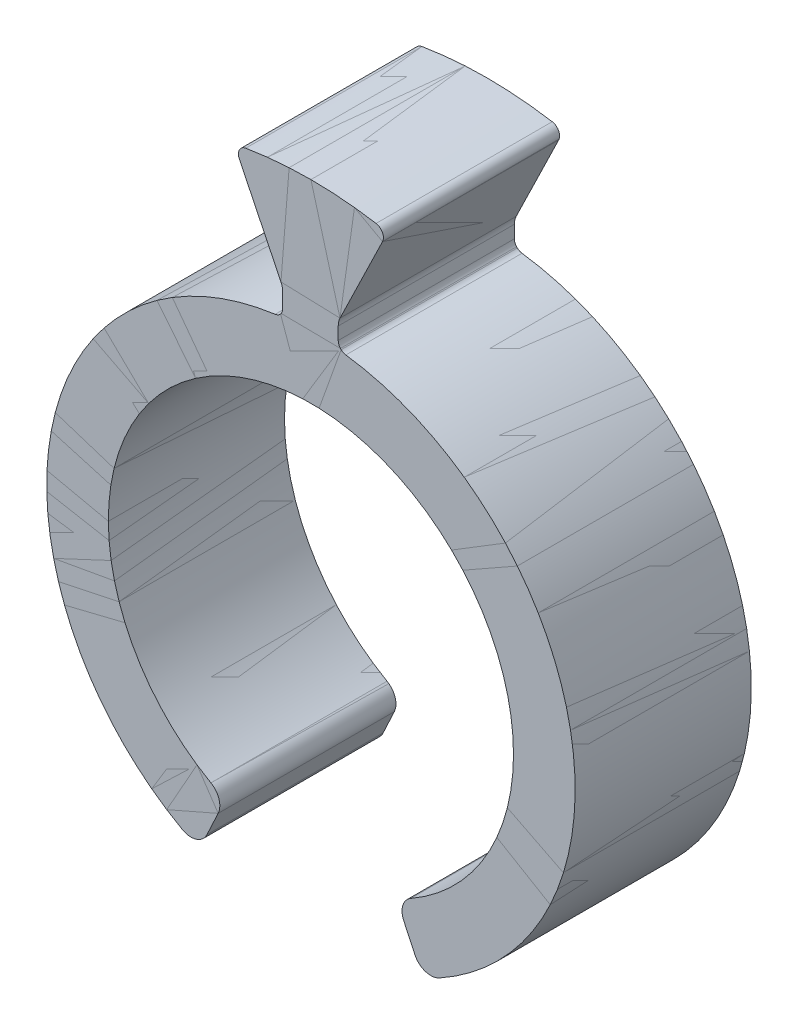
ISO-10303-21;
HEADER;
FILE_DESCRIPTION(('STEP AP214'),'2;1');
FILE_NAME('part.step','',(''),(''),'','','');
FILE_SCHEMA(('AUTOMOTIVE_DESIGN { 1 0 10303 214 1 1 1 1 }'));
ENDSEC;
DATA;
#1=APPLICATION_CONTEXT('core data for automotive mechanical design processes');
#2=APPLICATION_PROTOCOL_DEFINITION('international standard','automotive_design',2000,#1);
#3=PRODUCT_CONTEXT('',#1,'mechanical');
#4=PRODUCT('Part','Part','',(#3));
#5=PRODUCT_RELATED_PRODUCT_CATEGORY('part','',(#4));
#6=PRODUCT_DEFINITION_FORMATION('','',#4);
#7=PRODUCT_DEFINITION_CONTEXT('part definition',#1,'design');
#8=PRODUCT_DEFINITION('design','',#6,#7);
#9=PRODUCT_DEFINITION_SHAPE('','',#8);
#10=(LENGTH_UNIT() NAMED_UNIT(*) SI_UNIT(.MILLI.,.METRE.));
#11=(NAMED_UNIT(*) PLANE_ANGLE_UNIT() SI_UNIT($,.RADIAN.));
#12=(NAMED_UNIT(*) SI_UNIT($,.STERADIAN.) SOLID_ANGLE_UNIT());
#13=UNCERTAINTY_MEASURE_WITH_UNIT(LENGTH_MEASURE(1.E-05),#10,'distance_accuracy_value','');
#14=(GEOMETRIC_REPRESENTATION_CONTEXT(3) GLOBAL_UNCERTAINTY_ASSIGNED_CONTEXT((#13)) GLOBAL_UNIT_ASSIGNED_CONTEXT((#10,
#11,#12)) REPRESENTATION_CONTEXT('',''));
#15=CARTESIAN_POINT('',(0.,0.,0.));
#16=DIRECTION('',(0.,0.,1.));
#17=DIRECTION('',(1.,0.,0.));
#18=AXIS2_PLACEMENT_3D('',#15,#16,#17);
#19=CARTESIAN_POINT('',(8.83337144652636,-6.81471511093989,-5.));
#20=DIRECTION('',(0.,0.,-1.));
#21=DIRECTION('',(-1.,0.,0.));
#22=AXIS2_PLACEMENT_3D('',#19,#20,#21);
#23=PLANE('',#22);
#24=DIRECTION('',(0.43721847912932,0.899355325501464,0.));
#25=VECTOR('',#24,1.);
#26=CARTESIAN_POINT('',(1.9182073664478,10.5053222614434,-5.));
#27=LINE('',#26,#25);
#28=CARTESIAN_POINT('',(0.825161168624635,8.25693394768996,-5.));
#29=VERTEX_POINT('',#28);
#30=CARTESIAN_POINT('',(2.03282757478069,10.7410952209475,-5.));
#31=VERTEX_POINT('',#30);
#32=EDGE_CURVE('P0_E491',#29,#31,#27,.T.);
#33=ORIENTED_EDGE('',*,*,#32,.F.);
#34=CARTESIAN_POINT('',(1.2748388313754,8.0383247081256,-5.));
#35=DIRECTION('',(0.,0.,-1.));
#36=DIRECTION('',(-1.,0.,0.));
#37=AXIS2_PLACEMENT_3D('',#34,#35,#36);
#38=CIRCLE('',#37,0.500000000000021);
#39=CARTESIAN_POINT('',(0.774838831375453,8.03832470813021,-5.));
#40=VERTEX_POINT('',#39);
#41=EDGE_CURVE('P0_E354',#40,#29,#38,.T.);
#42=ORIENTED_EDGE('',*,*,#41,.F.);
#43=DIRECTION('',(1.83880037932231E-11,1.,0.));
#44=VECTOR('',#43,1.);
#45=CARTESIAN_POINT('',(0.77483883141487,10.1819402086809,-5.));
#46=LINE('',#45,#44);
#47=CARTESIAN_POINT('',(0.7748388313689,7.6819402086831,-5.));
#48=VERTEX_POINT('',#47);
#49=EDGE_CURVE('P0_E489',#48,#40,#46,.T.);
#50=ORIENTED_EDGE('',*,*,#49,.F.);
#51=CARTESIAN_POINT('',(1.0248388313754,7.6819402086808,-5.));
#52=DIRECTION('',(0.,0.,-1.));
#53=DIRECTION('',(-1.,0.,0.));
#54=AXIS2_PLACEMENT_3D('',#51,#52,#53);
#55=CIRCLE('',#54,0.250000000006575);
#56=CARTESIAN_POINT('',(0.991779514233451,7.43413568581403,-5.));
#57=VERTEX_POINT('',#56);
#58=EDGE_CURVE('P0_E504',#57,#48,#55,.T.);
#59=ORIENTED_EDGE('',*,*,#58,.F.);
#60=CARTESIAN_POINT('',(0.,0.,-5.));
#61=DIRECTION('',(0.,0.,1.));
#62=DIRECTION('',(0.,-1.,0.));
#63=AXIS2_PLACEMENT_3D('',#60,#61,#62);
#64=CIRCLE('',#63,7.49999999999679);
#65=CARTESIAN_POINT('',(3.64706284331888,-6.55354351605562,-5.));
#66=VERTEX_POINT('',#65);
#67=EDGE_CURVE('P0_E582',#57,#66,#64,.F.);
#68=ORIENTED_EDGE('',*,*,#67,.T.);
#69=CARTESIAN_POINT('',(3.4039253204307,-6.1166406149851,-5.));
#70=DIRECTION('',(0.,0.,1.));
#71=DIRECTION('',(1.,0.,0.));
#72=AXIS2_PLACEMENT_3D('',#69,#70,#71);
#73=CIRCLE('',#72,0.500000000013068);
#74=CARTESIAN_POINT('',(2.950771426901,-6.32794974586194,-5.));
#75=VERTEX_POINT('',#74);
#76=EDGE_CURVE('P0_E512',#66,#75,#73,.F.);
#77=ORIENTED_EDGE('',*,*,#76,.T.);
#78=DIRECTION('',(0.42261826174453,-0.906307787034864,0.));
#79=VECTOR('',#78,1.);
#80=CARTESIAN_POINT('',(3.68944385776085,-7.912037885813,-5.));
#81=LINE('',#80,#79);
#82=CARTESIAN_POINT('',(2.63289820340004,-5.64626841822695,-5.));
#83=VERTEX_POINT('',#82);
#84=EDGE_CURVE('P0_E509',#83,#75,#81,.T.);
#85=ORIENTED_EDGE('',*,*,#84,.F.);
#86=CARTESIAN_POINT('',(3.0860520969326,-5.4349592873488,-5.));
#87=DIRECTION('',(0.,0.,1.));
#88=DIRECTION('',(0.,-1.,0.));
#89=AXIS2_PLACEMENT_3D('',#86,#87,#88);
#90=CIRCLE('',#89,0.50000000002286);
#91=CARTESIAN_POINT('',(2.83916792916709,-5.00016254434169,-5.));
#92=VERTEX_POINT('',#91);
#93=EDGE_CURVE('P0_E587',#83,#92,#90,.F.);
#94=ORIENTED_EDGE('',*,*,#93,.T.);
#95=CARTESIAN_POINT('',(0.,0.,-5.));
#96=DIRECTION('',(0.,0.,-1.));
#97=DIRECTION('',(-1.,0.,0.));
#98=AXIS2_PLACEMENT_3D('',#95,#96,#97);
#99=CIRCLE('',#98,5.7499999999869);
#100=CARTESIAN_POINT('',(-2.83916792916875,-5.00016254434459,-5.));
#101=VERTEX_POINT('',#100);
#102=EDGE_CURVE('P0_E590',#101,#92,#99,.T.);
#103=ORIENTED_EDGE('',*,*,#102,.F.);
#104=CARTESIAN_POINT('',(-3.0860520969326,-5.4349592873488,-5.));
#105=DIRECTION('',(0.,0.,1.));
#106=DIRECTION('',(0.,-1.,0.));
#107=AXIS2_PLACEMENT_3D('',#104,#105,#106);
#108=CIRCLE('',#107,0.50000000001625);
#109=CARTESIAN_POINT('',(-2.6328982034,-5.64626841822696,-5.));
#110=VERTEX_POINT('',#109);
#111=EDGE_CURVE('P0_E517',#101,#110,#108,.F.);
#112=ORIENTED_EDGE('',*,*,#111,.T.);
#113=DIRECTION('',(0.422618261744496,0.90630778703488,0.));
#114=VECTOR('',#113,1.);
#115=CARTESIAN_POINT('',(-1.89422577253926,-4.0621802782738,-5.));
#116=LINE('',#115,#114);
#117=CARTESIAN_POINT('',(-2.95077142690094,-6.32794974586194,-5.));
#118=VERTEX_POINT('',#117);
#119=EDGE_CURVE('P0_E514',#118,#110,#116,.T.);
#120=ORIENTED_EDGE('',*,*,#119,.F.);
#121=CARTESIAN_POINT('',(-3.4039253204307,-6.1166406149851,-5.));
#122=DIRECTION('',(0.,0.,1.));
#123=DIRECTION('',(1.,0.,0.));
#124=AXIS2_PLACEMENT_3D('',#121,#122,#123);
#125=CIRCLE('',#124,0.500000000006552);
#126=CARTESIAN_POINT('',(-3.6470628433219,-6.55354351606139,-5.));
#127=VERTEX_POINT('',#126);
#128=EDGE_CURVE('P0_E596',#118,#127,#125,.F.);
#129=ORIENTED_EDGE('',*,*,#128,.T.);
#130=CARTESIAN_POINT('',(0.,0.,-5.));
#131=DIRECTION('',(0.,0.,1.));
#132=DIRECTION('',(0.,-1.,0.));
#133=AXIS2_PLACEMENT_3D('',#130,#131,#132);
#134=CIRCLE('',#133,7.49999999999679);
#135=CARTESIAN_POINT('',(-1.01612903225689,7.43084664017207,-5.));
#136=VERTEX_POINT('',#135);
#137=EDGE_CURVE('P0_E600',#127,#136,#134,.F.);
#138=ORIENTED_EDGE('',*,*,#137,.T.);
#139=CARTESIAN_POINT('',(-1.0499999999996,7.6785415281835,-5.));
#140=DIRECTION('',(0.,0.,-1.));
#141=DIRECTION('',(-1.,0.,0.));
#142=AXIS2_PLACEMENT_3D('',#139,#140,#141);
#143=CIRCLE('',#142,0.250000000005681);
#144=CARTESIAN_POINT('',(-0.799999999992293,7.67854152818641,-5.));
#145=VERTEX_POINT('',#144);
#146=EDGE_CURVE('P0_E602',#145,#136,#143,.T.);
#147=ORIENTED_EDGE('',*,*,#146,.F.);
#148=DIRECTION('',(2.24620235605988E-11,-1.,0.));
#149=VECTOR('',#148,1.);
#150=CARTESIAN_POINT('',(-0.799999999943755,5.5900810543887,-5.));
#151=LINE('',#150,#149);
#152=CARTESIAN_POINT('',(-0.79999999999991,8.09008105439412,-5.));
#153=VERTEX_POINT('',#152);
#154=EDGE_CURVE('P0_E519',#153,#145,#151,.T.);
#155=ORIENTED_EDGE('',*,*,#154,.F.);
#156=CARTESIAN_POINT('',(-1.2999999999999,8.0900810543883,-5.));
#157=DIRECTION('',(0.,0.,-1.));
#158=DIRECTION('',(-1.,0.,0.));
#159=AXIS2_PLACEMENT_3D('',#156,#157,#158);
#160=CIRCLE('',#159,0.499999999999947);
#161=CARTESIAN_POINT('',(-0.850322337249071,8.30869029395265,-5.));
#162=VERTEX_POINT('',#161);
#163=EDGE_CURVE('P0_E605',#162,#153,#160,.T.);
#164=ORIENTED_EDGE('',*,*,#163,.F.);
#165=DIRECTION('',(0.437218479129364,-0.899355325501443,0.));
#166=VECTOR('',#165,1.);
#167=CARTESIAN_POINT('',(-0.939781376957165,8.49270690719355,-5.));
#168=LINE('',#167,#166);
#169=CARTESIAN_POINT('',(-2.03282757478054,10.7410952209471,-5.));
#170=VERTEX_POINT('',#169);
#171=EDGE_CURVE('P0_E523',#170,#162,#168,.T.);
#172=ORIENTED_EDGE('',*,*,#171,.F.);
#173=CARTESIAN_POINT('',(-1.8079887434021,10.850399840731,-5.));
#174=DIRECTION('',(0.,0.,1.));
#175=DIRECTION('',(0.,-1.,0.));
#176=AXIS2_PLACEMENT_3D('',#173,#174,#175);
#177=CIRCLE('',#176,0.250000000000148);
#178=CARTESIAN_POINT('',(-1.84907939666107,11.0969998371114,-5.));
#179=VERTEX_POINT('',#178);
#180=EDGE_CURVE('P0_E607',#170,#179,#177,.F.);
#181=ORIENTED_EDGE('',*,*,#180,.T.);
#182=CARTESIAN_POINT('',(0.,0.,-5.));
#183=DIRECTION('',(0.,0.,1.));
#184=DIRECTION('',(1.,0.,0.));
#185=AXIS2_PLACEMENT_3D('',#182,#183,#184);
#186=CIRCLE('',#185,11.25);
#187=CARTESIAN_POINT('',(1.84907875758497,11.0969999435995,-5.));
#188=VERTEX_POINT('',#187);
#189=EDGE_CURVE('P0_E611',#179,#188,#186,.F.);
#190=ORIENTED_EDGE('',*,*,#189,.T.);
#191=CARTESIAN_POINT('',(1.8079887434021,10.850399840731,-5.));
#192=DIRECTION('',(0.,0.,1.));
#193=DIRECTION('',(0.,-1.,0.));
#194=AXIS2_PLACEMENT_3D('',#191,#192,#193);
#195=CIRCLE('',#194,0.250000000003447);
#196=EDGE_CURVE('P0_E528',#188,#31,#195,.F.);
#197=ORIENTED_EDGE('',*,*,#196,.T.);
#198=EDGE_LOOP('',(#33,#42,#50,#59,#68,#77,#85,#94,#103,#112,#120,#129,#138,#147,#155,#164,#172,
#181,#190,#197));
#199=FACE_BOUND('',#198,.T.);
#200=ADVANCED_FACE('P0_F350',(#199),#23,.T.);
#201=CARTESIAN_POINT('',(1.2748388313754,8.0383247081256,0.));
#202=DIRECTION('',(0.,0.,-1.));
#203=DIRECTION('',(-1.,0.,0.));
#204=AXIS2_PLACEMENT_3D('',#201,#202,#203);
#205=CYLINDRICAL_SURFACE('',#204,0.500000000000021);
#206=ORIENTED_EDGE('',*,*,#41,.T.);
#207=DIRECTION('',(0.,0.,-1.));
#208=VECTOR('',#207,1.);
#209=CARTESIAN_POINT('',(0.82516116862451,8.2569339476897,-2.5));
#210=LINE('',#209,#208);
#211=CARTESIAN_POINT('',(0.825161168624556,8.25693394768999,0.));
#212=VERTEX_POINT('',#211);
#213=EDGE_CURVE('P0_E494',#212,#29,#210,.T.);
#214=ORIENTED_EDGE('',*,*,#213,.F.);
#215=CARTESIAN_POINT('',(1.2748388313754,8.0383247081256,0.));
#216=DIRECTION('',(0.,0.,-1.));
#217=DIRECTION('',(-1.,0.,0.));
#218=AXIS2_PLACEMENT_3D('',#215,#216,#217);
#219=CIRCLE('',#218,0.500000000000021);
#220=CARTESIAN_POINT('',(0.774838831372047,8.03832470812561,0.));
#221=VERTEX_POINT('',#220);
#222=EDGE_CURVE('P0_E499',#221,#212,#219,.T.);
#223=ORIENTED_EDGE('',*,*,#222,.F.);
#224=DIRECTION('',(0.,0.,1.));
#225=VECTOR('',#224,1.);
#226=CARTESIAN_POINT('',(0.774838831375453,8.03832470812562,-2.5));
#227=LINE('',#226,#225);
#228=EDGE_CURVE('P0_E496',#40,#221,#227,.T.);
#229=ORIENTED_EDGE('',*,*,#228,.F.);
#230=EDGE_LOOP('',(#206,#214,#223,#229));
#231=FACE_BOUND('',#230,.T.);
#232=ADVANCED_FACE('P0_F497',(#231),#205,.F.);
#233=CARTESIAN_POINT('',(0.82516116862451,8.2569339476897,0.));
#234=DIRECTION('',(0.899355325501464,-0.43721847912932,0.));
#235=DIRECTION('',(0.,0.,-1.));
#236=AXIS2_PLACEMENT_3D('',#233,#234,#235);
#237=PLANE('',#236);
#238=ORIENTED_EDGE('',*,*,#32,.T.);
#239=DIRECTION('',(0.,0.,1.));
#240=VECTOR('',#239,1.);
#241=CARTESIAN_POINT('',(2.03282757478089,10.7410952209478,-2.5));
#242=LINE('',#241,#240);
#243=CARTESIAN_POINT('',(2.03282757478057,10.7410952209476,0.));
#244=VERTEX_POINT('',#243);
#245=EDGE_CURVE('P0_E612',#31,#244,#242,.T.);
#246=ORIENTED_EDGE('',*,*,#245,.T.);
#247=DIRECTION('',(0.437218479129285,0.899355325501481,0.));
#248=VECTOR('',#247,1.);
#249=CARTESIAN_POINT('',(0.825161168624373,8.2569339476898,0.));
#250=LINE('',#249,#248);
#251=EDGE_CURVE('P0_E576',#212,#244,#250,.T.);
#252=ORIENTED_EDGE('',*,*,#251,.F.);
#253=ORIENTED_EDGE('',*,*,#213,.T.);
#254=EDGE_LOOP('',(#238,#246,#252,#253));
#255=FACE_BOUND('',#254,.T.);
#256=ADVANCED_FACE('P0_F694',(#255),#237,.T.);
#257=CARTESIAN_POINT('',(1.8079887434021,10.850399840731,-5.));
#258=DIRECTION('',(0.,0.,1.));
#259=DIRECTION('',(0.,-1.,0.));
#260=AXIS2_PLACEMENT_3D('',#257,#258,#259);
#261=CYLINDRICAL_SURFACE('',#260,0.250000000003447);
#262=ORIENTED_EDGE('',*,*,#245,.F.);
#263=ORIENTED_EDGE('',*,*,#196,.F.);
#264=DIRECTION('',(0.,0.,1.));
#265=VECTOR('',#264,1.);
#266=CARTESIAN_POINT('',(1.84907811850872,11.097000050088,-2.5));
#267=LINE('',#266,#265);
#268=CARTESIAN_POINT('',(1.84907875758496,11.0969999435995,0.));
#269=VERTEX_POINT('',#268);
#270=EDGE_CURVE('P0_E610',#188,#269,#267,.T.);
#271=ORIENTED_EDGE('',*,*,#270,.T.);
#272=CARTESIAN_POINT('',(1.8079887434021,10.850399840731,0.));
#273=DIRECTION('',(0.,0.,1.));
#274=DIRECTION('',(0.,-1.,0.));
#275=AXIS2_PLACEMENT_3D('',#272,#273,#274);
#276=CIRCLE('',#275,0.250000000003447);
#277=EDGE_CURVE('P0_E573',#244,#269,#276,.T.);
#278=ORIENTED_EDGE('',*,*,#277,.F.);
#279=EDGE_LOOP('',(#262,#263,#271,#278));
#280=FACE_BOUND('',#279,.T.);
#281=ADVANCED_FACE('P0_F696',(#280),#261,.T.);
#282=CARTESIAN_POINT('',(0.,0.,-5.));
#283=DIRECTION('',(0.,0.,1.));
#284=DIRECTION('',(1.,0.,0.));
#285=AXIS2_PLACEMENT_3D('',#282,#283,#284);
#286=CYLINDRICAL_SURFACE('',#285,11.25);
#287=ORIENTED_EDGE('',*,*,#270,.F.);
#288=ORIENTED_EDGE('',*,*,#189,.F.);
#289=DIRECTION('',(0.,0.,1.));
#290=VECTOR('',#289,1.);
#291=CARTESIAN_POINT('',(-1.84907939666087,11.0969998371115,-2.5));
#292=LINE('',#291,#290);
#293=CARTESIAN_POINT('',(-1.84907939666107,11.0969998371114,0.));
#294=VERTEX_POINT('',#293);
#295=EDGE_CURVE('P0_E609',#179,#294,#292,.T.);
#296=ORIENTED_EDGE('',*,*,#295,.T.);
#297=CARTESIAN_POINT('',(0.,0.,0.));
#298=DIRECTION('',(0.,0.,1.));
#299=DIRECTION('',(1.,0.,0.));
#300=AXIS2_PLACEMENT_3D('',#297,#298,#299);
#301=CIRCLE('',#300,11.25);
#302=EDGE_CURVE('P0_E570',#269,#294,#301,.T.);
#303=ORIENTED_EDGE('',*,*,#302,.F.);
#304=EDGE_LOOP('',(#287,#288,#296,#303));
#305=FACE_BOUND('',#304,.T.);
#306=ADVANCED_FACE('P0_F701',(#305),#286,.T.);
#307=CARTESIAN_POINT('',(-1.8079887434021,10.850399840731,-5.));
#308=DIRECTION('',(0.,0.,1.));
#309=DIRECTION('',(0.,-1.,0.));
#310=AXIS2_PLACEMENT_3D('',#307,#308,#309);
#311=CYLINDRICAL_SURFACE('',#310,0.250000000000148);
#312=ORIENTED_EDGE('',*,*,#295,.F.);
#313=ORIENTED_EDGE('',*,*,#180,.F.);
#314=DIRECTION('',(0.,0.,-1.));
#315=VECTOR('',#314,1.);
#316=CARTESIAN_POINT('',(-2.0328275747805,10.741095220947,-2.5));
#317=LINE('',#316,#315);
#318=CARTESIAN_POINT('',(-2.03282757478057,10.7410952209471,0.));
#319=VERTEX_POINT('',#318);
#320=EDGE_CURVE('P0_E526',#319,#170,#317,.T.);
#321=ORIENTED_EDGE('',*,*,#320,.F.);
#322=CARTESIAN_POINT('',(-1.8079887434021,10.850399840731,0.));
#323=DIRECTION('',(0.,0.,1.));
#324=DIRECTION('',(0.,-1.,0.));
#325=AXIS2_PLACEMENT_3D('',#322,#323,#324);
#326=CIRCLE('',#325,0.250000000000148);
#327=EDGE_CURVE('P0_E567',#294,#319,#326,.T.);
#328=ORIENTED_EDGE('',*,*,#327,.F.);
#329=EDGE_LOOP('',(#312,#313,#321,#328));
#330=FACE_BOUND('',#329,.T.);
#331=ADVANCED_FACE('P0_F706',(#330),#311,.T.);
#332=CARTESIAN_POINT('',(-2.0328275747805,10.741095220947,0.));
#333=DIRECTION('',(-0.899355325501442,-0.437218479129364,0.));
#334=DIRECTION('',(0.,0.,-1.));
#335=AXIS2_PLACEMENT_3D('',#332,#333,#334);
#336=PLANE('',#335);
#337=ORIENTED_EDGE('',*,*,#171,.T.);
#338=DIRECTION('',(0.,0.,-1.));
#339=VECTOR('',#338,1.);
#340=CARTESIAN_POINT('',(-0.850322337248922,8.30869029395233,-2.5));
#341=LINE('',#340,#339);
#342=CARTESIAN_POINT('',(-0.850322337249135,8.30869029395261,0.));
#343=VERTEX_POINT('',#342);
#344=EDGE_CURVE('P0_E525',#343,#162,#341,.T.);
#345=ORIENTED_EDGE('',*,*,#344,.F.);
#346=DIRECTION('',(0.437218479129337,-0.899355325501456,0.));
#347=VECTOR('',#346,1.);
#348=CARTESIAN_POINT('',(-2.03282757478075,10.7410952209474,0.));
#349=LINE('',#348,#347);
#350=EDGE_CURVE('P0_E564',#319,#343,#349,.T.);
#351=ORIENTED_EDGE('',*,*,#350,.F.);
#352=ORIENTED_EDGE('',*,*,#320,.T.);
#353=EDGE_LOOP('',(#337,#345,#351,#352));
#354=FACE_BOUND('',#353,.T.);
#355=ADVANCED_FACE('P0_F709',(#354),#336,.T.);
#356=CARTESIAN_POINT('',(-1.2999999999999,8.0900810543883,0.));
#357=DIRECTION('',(0.,0.,-1.));
#358=DIRECTION('',(-1.,0.,0.));
#359=AXIS2_PLACEMENT_3D('',#356,#357,#358);
#360=CYLINDRICAL_SURFACE('',#359,0.499999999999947);
#361=ORIENTED_EDGE('',*,*,#163,.T.);
#362=DIRECTION('',(0.,0.,-1.));
#363=VECTOR('',#362,1.);
#364=CARTESIAN_POINT('',(-0.79999999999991,8.0900810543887,-2.5));
#365=LINE('',#364,#363);
#366=CARTESIAN_POINT('',(-0.799999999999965,8.0900810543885,0.));
#367=VERTEX_POINT('',#366);
#368=EDGE_CURVE('P0_E522',#367,#153,#365,.T.);
#369=ORIENTED_EDGE('',*,*,#368,.F.);
#370=CARTESIAN_POINT('',(-1.2999999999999,8.0900810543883,0.));
#371=DIRECTION('',(0.,0.,-1.));
#372=DIRECTION('',(-1.,0.,0.));
#373=AXIS2_PLACEMENT_3D('',#370,#371,#372);
#374=CIRCLE('',#373,0.499999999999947);
#375=EDGE_CURVE('P0_E561',#343,#367,#374,.T.);
#376=ORIENTED_EDGE('',*,*,#375,.F.);
#377=ORIENTED_EDGE('',*,*,#344,.T.);
#378=EDGE_LOOP('',(#361,#369,#376,#377));
#379=FACE_BOUND('',#378,.T.);
#380=ADVANCED_FACE('P0_F712',(#379),#360,.F.);
#381=CARTESIAN_POINT('',(-0.79999999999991,8.0900810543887,0.));
#382=DIRECTION('',(-1.,-2.24620235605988E-11,0.));
#383=DIRECTION('',(0.,0.,-1.));
#384=AXIS2_PLACEMENT_3D('',#381,#382,#383);
#385=PLANE('',#384);
#386=ORIENTED_EDGE('',*,*,#154,.T.);
#387=DIRECTION('',(0.,0.,-1.));
#388=VECTOR('',#387,1.);
#389=CARTESIAN_POINT('',(-0.799999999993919,7.67854152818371,-2.5));
#390=LINE('',#389,#388);
#391=CARTESIAN_POINT('',(-0.79999999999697,7.67854152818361,0.));
#392=VERTEX_POINT('',#391);
#393=EDGE_CURVE('P0_E521',#392,#145,#390,.T.);
#394=ORIENTED_EDGE('',*,*,#393,.F.);
#395=DIRECTION('',(0.,-1.,0.));
#396=VECTOR('',#395,1.);
#397=CARTESIAN_POINT('',(-0.80000000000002,2.30697564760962,0.));
#398=LINE('',#397,#396);
#399=EDGE_CURVE('P0_E560',#367,#392,#398,.T.);
#400=ORIENTED_EDGE('',*,*,#399,.F.);
#401=ORIENTED_EDGE('',*,*,#368,.T.);
#402=EDGE_LOOP('',(#386,#394,#400,#401));
#403=FACE_BOUND('',#402,.T.);
#404=ADVANCED_FACE('P0_F649',(#403),#385,.T.);
#405=CARTESIAN_POINT('',(-1.0499999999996,7.6785415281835,0.));
#406=DIRECTION('',(0.,0.,-1.));
#407=DIRECTION('',(-1.,0.,0.));
#408=AXIS2_PLACEMENT_3D('',#405,#406,#407);
#409=CYLINDRICAL_SURFACE('',#408,0.250000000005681);
#410=ORIENTED_EDGE('',*,*,#146,.T.);
#411=DIRECTION('',(0.,0.,1.));
#412=VECTOR('',#411,1.);
#413=CARTESIAN_POINT('',(-1.01612903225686,7.43084664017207,-2.5));
#414=LINE('',#413,#412);
#415=CARTESIAN_POINT('',(-1.01612903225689,7.43084664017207,0.));
#416=VERTEX_POINT('',#415);
#417=EDGE_CURVE('P0_E599',#136,#416,#414,.T.);
#418=ORIENTED_EDGE('',*,*,#417,.T.);
#419=CARTESIAN_POINT('',(-1.0499999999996,7.6785415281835,0.));
#420=DIRECTION('',(0.,0.,-1.));
#421=DIRECTION('',(-1.,0.,0.));
#422=AXIS2_PLACEMENT_3D('',#419,#420,#421);
#423=CIRCLE('',#422,0.250000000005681);
#424=EDGE_CURVE('P0_E557',#392,#416,#423,.T.);
#425=ORIENTED_EDGE('',*,*,#424,.F.);
#426=ORIENTED_EDGE('',*,*,#393,.T.);
#427=EDGE_LOOP('',(#410,#418,#425,#426));
#428=FACE_BOUND('',#427,.T.);
#429=ADVANCED_FACE('P0_F653',(#428),#409,.F.);
#430=CARTESIAN_POINT('',(0.,0.,-5.));
#431=DIRECTION('',(0.,0.,1.));
#432=DIRECTION('',(0.,-1.,0.));
#433=AXIS2_PLACEMENT_3D('',#430,#431,#432);
#434=CYLINDRICAL_SURFACE('',#433,7.49999999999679);
#435=ORIENTED_EDGE('',*,*,#417,.F.);
#436=ORIENTED_EDGE('',*,*,#137,.F.);
#437=DIRECTION('',(0.,0.,1.));
#438=VECTOR('',#437,1.);
#439=CARTESIAN_POINT('',(-3.6470628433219,-6.5535435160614,-2.5));
#440=LINE('',#439,#438);
#441=CARTESIAN_POINT('',(-3.6470628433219,-6.55354351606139,0.));
#442=VERTEX_POINT('',#441);
#443=EDGE_CURVE('P0_E598',#127,#442,#440,.T.);
#444=ORIENTED_EDGE('',*,*,#443,.T.);
#445=CARTESIAN_POINT('',(0.,0.,0.));
#446=DIRECTION('',(0.,0.,1.));
#447=DIRECTION('',(0.,-1.,0.));
#448=AXIS2_PLACEMENT_3D('',#445,#446,#447);
#449=CIRCLE('',#448,7.49999999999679);
#450=EDGE_CURVE('P0_E554',#416,#442,#449,.T.);
#451=ORIENTED_EDGE('',*,*,#450,.F.);
#452=EDGE_LOOP('',(#435,#436,#444,#451));
#453=FACE_BOUND('',#452,.T.);
#454=ADVANCED_FACE('P0_F658',(#453),#434,.T.);
#455=CARTESIAN_POINT('',(-3.4039253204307,-6.1166406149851,-5.));
#456=DIRECTION('',(0.,0.,1.));
#457=DIRECTION('',(1.,0.,0.));
#458=AXIS2_PLACEMENT_3D('',#455,#456,#457);
#459=CYLINDRICAL_SURFACE('',#458,0.500000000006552);
#460=ORIENTED_EDGE('',*,*,#443,.F.);
#461=ORIENTED_EDGE('',*,*,#128,.F.);
#462=DIRECTION('',(0.,0.,-1.));
#463=VECTOR('',#462,1.);
#464=CARTESIAN_POINT('',(-2.9507714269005,-6.327949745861,-2.5));
#465=LINE('',#464,#463);
#466=CARTESIAN_POINT('',(-2.95077142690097,-6.32794974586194,0.));
#467=VERTEX_POINT('',#466);
#468=EDGE_CURVE('P0_E518',#467,#118,#465,.T.);
#469=ORIENTED_EDGE('',*,*,#468,.F.);
#470=CARTESIAN_POINT('',(-3.4039253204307,-6.1166406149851,0.));
#471=DIRECTION('',(0.,0.,1.));
#472=DIRECTION('',(1.,0.,0.));
#473=AXIS2_PLACEMENT_3D('',#470,#471,#472);
#474=CIRCLE('',#473,0.500000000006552);
#475=EDGE_CURVE('P0_E551',#442,#467,#474,.T.);
#476=ORIENTED_EDGE('',*,*,#475,.F.);
#477=EDGE_LOOP('',(#460,#461,#469,#476));
#478=FACE_BOUND('',#477,.T.);
#479=ADVANCED_FACE('P0_F663',(#478),#459,.T.);
#480=CARTESIAN_POINT('',(-2.9507714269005,-6.327949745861,0.));
#481=DIRECTION('',(0.90630778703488,-0.422618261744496,0.));
#482=DIRECTION('',(0.,0.,-1.));
#483=AXIS2_PLACEMENT_3D('',#480,#481,#482);
#484=PLANE('',#483);
#485=ORIENTED_EDGE('',*,*,#119,.T.);
#486=DIRECTION('',(0.,0.,1.));
#487=VECTOR('',#486,1.);
#488=CARTESIAN_POINT('',(-2.63289820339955,-5.64626841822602,-2.5));
#489=LINE('',#488,#487);
#490=CARTESIAN_POINT('',(-2.63289820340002,-5.64626841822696,0.));
#491=VERTEX_POINT('',#490);
#492=EDGE_CURVE('P0_E595',#110,#491,#489,.T.);
#493=ORIENTED_EDGE('',*,*,#492,.T.);
#494=DIRECTION('',(0.422618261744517,0.90630778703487,0.));
#495=VECTOR('',#494,1.);
#496=CARTESIAN_POINT('',(-2.9507714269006,-6.32794974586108,0.));
#497=LINE('',#496,#495);
#498=EDGE_CURVE('P0_E548',#467,#491,#497,.T.);
#499=ORIENTED_EDGE('',*,*,#498,.F.);
#500=ORIENTED_EDGE('',*,*,#468,.T.);
#501=EDGE_LOOP('',(#485,#493,#499,#500));
#502=FACE_BOUND('',#501,.T.);
#503=ADVANCED_FACE('P0_F666',(#502),#484,.T.);
#504=CARTESIAN_POINT('',(-3.0860520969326,-5.4349592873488,-5.));
#505=DIRECTION('',(0.,0.,1.));
#506=DIRECTION('',(0.,-1.,0.));
#507=AXIS2_PLACEMENT_3D('',#504,#505,#506);
#508=CYLINDRICAL_SURFACE('',#507,0.50000000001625);
#509=ORIENTED_EDGE('',*,*,#492,.F.);
#510=ORIENTED_EDGE('',*,*,#111,.F.);
#511=DIRECTION('',(0.,0.,-1.));
#512=VECTOR('',#511,1.);
#513=CARTESIAN_POINT('',(-2.83916792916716,-5.00016254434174,-2.5));
#514=LINE('',#513,#512);
#515=CARTESIAN_POINT('',(-2.83916792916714,-5.00016254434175,0.));
#516=VERTEX_POINT('',#515);
#517=EDGE_CURVE('P0_E593',#516,#101,#514,.T.);
#518=ORIENTED_EDGE('',*,*,#517,.F.);
#519=CARTESIAN_POINT('',(-3.0860520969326,-5.4349592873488,0.));
#520=DIRECTION('',(0.,0.,1.));
#521=DIRECTION('',(0.,-1.,0.));
#522=AXIS2_PLACEMENT_3D('',#519,#520,#521);
#523=CIRCLE('',#522,0.50000000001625);
#524=EDGE_CURVE('P0_E545',#491,#516,#523,.T.);
#525=ORIENTED_EDGE('',*,*,#524,.F.);
#526=EDGE_LOOP('',(#509,#510,#518,#525));
#527=FACE_BOUND('',#526,.T.);
#528=ADVANCED_FACE('P0_F670',(#527),#508,.T.);
#529=CARTESIAN_POINT('',(0.,0.,0.));
#530=DIRECTION('',(0.,0.,-1.));
#531=DIRECTION('',(-1.,0.,0.));
#532=AXIS2_PLACEMENT_3D('',#529,#530,#531);
#533=CYLINDRICAL_SURFACE('',#532,5.7499999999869);
#534=ORIENTED_EDGE('',*,*,#102,.T.);
#535=DIRECTION('',(0.,0.,1.));
#536=VECTOR('',#535,1.);
#537=CARTESIAN_POINT('',(2.83916792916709,-5.00016254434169,-2.5));
#538=LINE('',#537,#536);
#539=CARTESIAN_POINT('',(2.83916792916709,-5.00016254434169,0.));
#540=VERTEX_POINT('',#539);
#541=EDGE_CURVE('P0_E589',#92,#540,#538,.T.);
#542=ORIENTED_EDGE('',*,*,#541,.T.);
#543=CARTESIAN_POINT('',(0.,0.,0.));
#544=DIRECTION('',(0.,0.,-1.));
#545=DIRECTION('',(-1.,0.,0.));
#546=AXIS2_PLACEMENT_3D('',#543,#544,#545);
#547=CIRCLE('',#546,5.7499999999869);
#548=EDGE_CURVE('P0_E542',#516,#540,#547,.T.);
#549=ORIENTED_EDGE('',*,*,#548,.F.);
#550=ORIENTED_EDGE('',*,*,#517,.T.);
#551=EDGE_LOOP('',(#534,#542,#549,#550));
#552=FACE_BOUND('',#551,.T.);
#553=ADVANCED_FACE('P0_F674',(#552),#533,.F.);
#554=CARTESIAN_POINT('',(3.0860520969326,-5.4349592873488,-5.));
#555=DIRECTION('',(0.,0.,1.));
#556=DIRECTION('',(0.,-1.,0.));
#557=AXIS2_PLACEMENT_3D('',#554,#555,#556);
#558=CYLINDRICAL_SURFACE('',#557,0.50000000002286);
#559=ORIENTED_EDGE('',*,*,#541,.F.);
#560=ORIENTED_EDGE('',*,*,#93,.F.);
#561=DIRECTION('',(0.,0.,-1.));
#562=VECTOR('',#561,1.);
#563=CARTESIAN_POINT('',(2.6328982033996,-5.646268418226,-2.5));
#564=LINE('',#563,#562);
#565=CARTESIAN_POINT('',(2.63289820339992,-5.64626841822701,0.));
#566=VERTEX_POINT('',#565);
#567=EDGE_CURVE('P0_E513',#566,#83,#564,.T.);
#568=ORIENTED_EDGE('',*,*,#567,.F.);
#569=CARTESIAN_POINT('',(3.0860520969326,-5.4349592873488,0.));
#570=DIRECTION('',(0.,0.,1.));
#571=DIRECTION('',(0.,-1.,0.));
#572=AXIS2_PLACEMENT_3D('',#569,#570,#571);
#573=CIRCLE('',#572,0.50000000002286);
#574=EDGE_CURVE('P0_E539',#540,#566,#573,.T.);
#575=ORIENTED_EDGE('',*,*,#574,.F.);
#576=EDGE_LOOP('',(#559,#560,#568,#575));
#577=FACE_BOUND('',#576,.T.);
#578=ADVANCED_FACE('P0_F678',(#577),#558,.T.);
#579=CARTESIAN_POINT('',(2.6328982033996,-5.646268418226,0.));
#580=DIRECTION('',(-0.906307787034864,-0.42261826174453,0.));
#581=DIRECTION('',(0.,0.,-1.));
#582=AXIS2_PLACEMENT_3D('',#579,#580,#581);
#583=PLANE('',#582);
#584=ORIENTED_EDGE('',*,*,#84,.T.);
#585=DIRECTION('',(0.,0.,1.));
#586=VECTOR('',#585,1.);
#587=CARTESIAN_POINT('',(2.95077142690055,-6.327949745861,-2.5));
#588=LINE('',#587,#586);
#589=CARTESIAN_POINT('',(2.95077142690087,-6.327949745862,0.));
#590=VERTEX_POINT('',#589);
#591=EDGE_CURVE('P0_E586',#75,#590,#588,.T.);
#592=ORIENTED_EDGE('',*,*,#591,.T.);
#593=DIRECTION('',(0.422618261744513,-0.906307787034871,0.));
#594=VECTOR('',#593,1.);
#595=CARTESIAN_POINT('',(2.63289820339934,-5.64626841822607,0.));
#596=LINE('',#595,#594);
#597=EDGE_CURVE('P0_E536',#566,#590,#596,.T.);
#598=ORIENTED_EDGE('',*,*,#597,.F.);
#599=ORIENTED_EDGE('',*,*,#567,.T.);
#600=EDGE_LOOP('',(#584,#592,#598,#599));
#601=FACE_BOUND('',#600,.T.);
#602=ADVANCED_FACE('P0_F682',(#601),#583,.T.);
#603=CARTESIAN_POINT('',(3.4039253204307,-6.1166406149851,-5.));
#604=DIRECTION('',(0.,0.,1.));
#605=DIRECTION('',(1.,0.,0.));
#606=AXIS2_PLACEMENT_3D('',#603,#604,#605);
#607=CYLINDRICAL_SURFACE('',#606,0.500000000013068);
#608=ORIENTED_EDGE('',*,*,#591,.F.);
#609=ORIENTED_EDGE('',*,*,#76,.F.);
#610=DIRECTION('',(0.,0.,1.));
#611=VECTOR('',#610,1.);
#612=CARTESIAN_POINT('',(3.64706284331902,-6.55354351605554,-2.5));
#613=LINE('',#612,#611);
#614=CARTESIAN_POINT('',(3.64706284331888,-6.55354351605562,0.));
#615=VERTEX_POINT('',#614);
#616=EDGE_CURVE('P0_E584',#66,#615,#613,.T.);
#617=ORIENTED_EDGE('',*,*,#616,.T.);
#618=CARTESIAN_POINT('',(3.4039253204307,-6.1166406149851,0.));
#619=DIRECTION('',(0.,0.,1.));
#620=DIRECTION('',(1.,0.,0.));
#621=AXIS2_PLACEMENT_3D('',#618,#619,#620);
#622=CIRCLE('',#621,0.500000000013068);
#623=EDGE_CURVE('P0_E533',#590,#615,#622,.T.);
#624=ORIENTED_EDGE('',*,*,#623,.F.);
#625=EDGE_LOOP('',(#608,#609,#617,#624));
#626=FACE_BOUND('',#625,.T.);
#627=ADVANCED_FACE('P0_F688',(#626),#607,.T.);
#628=CARTESIAN_POINT('',(0.,0.,-5.));
#629=DIRECTION('',(0.,0.,1.));
#630=DIRECTION('',(0.,-1.,0.));
#631=AXIS2_PLACEMENT_3D('',#628,#629,#630);
#632=CYLINDRICAL_SURFACE('',#631,7.49999999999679);
#633=DIRECTION('',(0.,0.,-1.));
#634=VECTOR('',#633,1.);
#635=CARTESIAN_POINT('',(0.991779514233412,7.43413568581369,-2.5));
#636=LINE('',#635,#634);
#637=CARTESIAN_POINT('',(0.991779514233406,7.4341356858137,0.));
#638=VERTEX_POINT('',#637);
#639=EDGE_CURVE('P0_E581',#638,#57,#636,.T.);
#640=ORIENTED_EDGE('',*,*,#639,.F.);
#641=CARTESIAN_POINT('',(0.,0.,0.));
#642=DIRECTION('',(0.,0.,1.));
#643=DIRECTION('',(0.,-1.,0.));
#644=AXIS2_PLACEMENT_3D('',#641,#642,#643);
#645=CIRCLE('',#644,7.49999999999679);
#646=EDGE_CURVE('P0_E531',#615,#638,#645,.T.);
#647=ORIENTED_EDGE('',*,*,#646,.F.);
#648=ORIENTED_EDGE('',*,*,#616,.F.);
#649=ORIENTED_EDGE('',*,*,#67,.F.);
#650=EDGE_LOOP('',(#640,#647,#648,#649));
#651=FACE_BOUND('',#650,.T.);
#652=ADVANCED_FACE('P0_F692',(#651),#632,.T.);
#653=CARTESIAN_POINT('',(1.0248388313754,7.6819402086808,0.));
#654=DIRECTION('',(0.,0.,-1.));
#655=DIRECTION('',(-1.,0.,0.));
#656=AXIS2_PLACEMENT_3D('',#653,#654,#655);
#657=CYLINDRICAL_SURFACE('',#656,0.250000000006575);
#658=ORIENTED_EDGE('',*,*,#58,.T.);
#659=DIRECTION('',(0.,0.,-1.));
#660=VECTOR('',#659,1.);
#661=CARTESIAN_POINT('',(0.7748388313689,7.6819402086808,-2.5));
#662=LINE('',#661,#660);
#663=CARTESIAN_POINT('',(0.774838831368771,7.6819402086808,0.));
#664=VERTEX_POINT('',#663);
#665=EDGE_CURVE('P0_E369',#664,#48,#662,.T.);
#666=ORIENTED_EDGE('',*,*,#665,.F.);
#667=CARTESIAN_POINT('',(1.0248388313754,7.6819402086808,0.));
#668=DIRECTION('',(0.,0.,-1.));
#669=DIRECTION('',(-1.,0.,0.));
#670=AXIS2_PLACEMENT_3D('',#667,#668,#669);
#671=CIRCLE('',#670,0.250000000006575);
#672=EDGE_CURVE('P0_E360',#638,#664,#671,.T.);
#673=ORIENTED_EDGE('',*,*,#672,.F.);
#674=ORIENTED_EDGE('',*,*,#639,.T.);
#675=EDGE_LOOP('',(#658,#666,#673,#674));
#676=FACE_BOUND('',#675,.T.);
#677=ADVANCED_FACE('P0_F693',(#676),#657,.F.);
#678=CARTESIAN_POINT('',(0.7748388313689,7.6819402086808,0.));
#679=DIRECTION('',(1.,-1.83880037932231E-11,0.));
#680=DIRECTION('',(0.,0.,-1.));
#681=AXIS2_PLACEMENT_3D('',#678,#679,#680);
#682=PLANE('',#681);
#683=ORIENTED_EDGE('',*,*,#49,.T.);
#684=ORIENTED_EDGE('',*,*,#228,.T.);
#685=DIRECTION('',(0.,1.,0.));
#686=VECTOR('',#685,1.);
#687=CARTESIAN_POINT('',(0.774838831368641,2.30697564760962,0.));
#688=LINE('',#687,#686);
#689=EDGE_CURVE('P0_E11',#664,#221,#688,.T.);
#690=ORIENTED_EDGE('',*,*,#689,.F.);
#691=ORIENTED_EDGE('',*,*,#665,.T.);
#692=EDGE_LOOP('',(#683,#684,#690,#691));
#693=FACE_BOUND('',#692,.T.);
#694=ADVANCED_FACE('P0_F502',(#693),#682,.T.);
#695=CARTESIAN_POINT('',(-23.3004058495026,-6.81471511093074,0.));
#696=DIRECTION('',(0.,0.,1.));
#697=DIRECTION('',(1.,0.,0.));
#698=AXIS2_PLACEMENT_3D('',#695,#696,#697);
#699=PLANE('',#698);
#700=ORIENTED_EDGE('',*,*,#672,.T.);
#701=ORIENTED_EDGE('',*,*,#689,.T.);
#702=ORIENTED_EDGE('',*,*,#222,.T.);
#703=ORIENTED_EDGE('',*,*,#251,.T.);
#704=ORIENTED_EDGE('',*,*,#277,.T.);
#705=ORIENTED_EDGE('',*,*,#302,.T.);
#706=ORIENTED_EDGE('',*,*,#327,.T.);
#707=ORIENTED_EDGE('',*,*,#350,.T.);
#708=ORIENTED_EDGE('',*,*,#375,.T.);
#709=ORIENTED_EDGE('',*,*,#399,.T.);
#710=ORIENTED_EDGE('',*,*,#424,.T.);
#711=ORIENTED_EDGE('',*,*,#450,.T.);
#712=ORIENTED_EDGE('',*,*,#475,.T.);
#713=ORIENTED_EDGE('',*,*,#498,.T.);
#714=ORIENTED_EDGE('',*,*,#524,.T.);
#715=ORIENTED_EDGE('',*,*,#548,.T.);
#716=ORIENTED_EDGE('',*,*,#574,.T.);
#717=ORIENTED_EDGE('',*,*,#597,.T.);
#718=ORIENTED_EDGE('',*,*,#623,.T.);
#719=ORIENTED_EDGE('',*,*,#646,.T.);
#720=EDGE_LOOP('',(#700,#701,#702,#703,#704,#705,#706,#707,#708,#709,#710,#711,#712,#713,#714,
#715,#716,#717,#718,#719));
#721=FACE_BOUND('',#720,.T.);
#722=ADVANCED_FACE('P0_F352',(#721),#699,.T.);
#723=CLOSED_SHELL('',(#200,#232,#256,#281,#306,#331,#355,#380,#404,#429,#454,#479,#503,#528,
#553,#578,#602,#627,#652,#677,#694,#722));
#724=MANIFOLD_SOLID_BREP('P0_B2',#723);
#725=CARTESIAN_POINT('',(8.83337144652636,-6.81471511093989,-5.));
#726=DIRECTION('',(0.,0.,-1.));
#727=DIRECTION('',(-1.,0.,0.));
#728=AXIS2_PLACEMENT_3D('',#725,#726,#727);
#729=PLANE('',#728);
#730=DIRECTION('',(0.43721847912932,0.899355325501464,0.));
#731=VECTOR('',#730,1.);
#732=CARTESIAN_POINT('',(1.9182073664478,10.5053222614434,-5.));
#733=LINE('',#732,#731);
#734=CARTESIAN_POINT('',(0.825161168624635,8.25693394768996,-5.));
#735=VERTEX_POINT('',#734);
#736=CARTESIAN_POINT('',(2.03282757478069,10.7410952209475,-5.));
#737=VERTEX_POINT('',#736);
#738=EDGE_CURVE('P1_E157',#735,#737,#733,.T.);
#739=ORIENTED_EDGE('',*,*,#738,.F.);
#740=CARTESIAN_POINT('',(1.2748388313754,8.0383247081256,-5.));
#741=DIRECTION('',(0.,0.,-1.));
#742=DIRECTION('',(-1.,0.,0.));
#743=AXIS2_PLACEMENT_3D('',#740,#741,#742);
#744=CIRCLE('',#743,0.500000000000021);
#745=CARTESIAN_POINT('',(0.774838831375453,8.03832470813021,-5.));
#746=VERTEX_POINT('',#745);
#747=EDGE_CURVE('P1_E20',#746,#735,#744,.T.);
#748=ORIENTED_EDGE('',*,*,#747,.F.);
#749=DIRECTION('',(1.83880037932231E-11,1.,0.));
#750=VECTOR('',#749,1.);
#751=CARTESIAN_POINT('',(0.77483883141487,10.1819402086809,-5.));
#752=LINE('',#751,#750);
#753=CARTESIAN_POINT('',(0.7748388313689,7.6819402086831,-5.));
#754=VERTEX_POINT('',#753);
#755=EDGE_CURVE('P1_E155',#754,#746,#752,.T.);
#756=ORIENTED_EDGE('',*,*,#755,.F.);
#757=CARTESIAN_POINT('',(1.0248388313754,7.6819402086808,-5.));
#758=DIRECTION('',(0.,0.,-1.));
#759=DIRECTION('',(-1.,0.,0.));
#760=AXIS2_PLACEMENT_3D('',#757,#758,#759);
#761=CIRCLE('',#760,0.250000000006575);
#762=CARTESIAN_POINT('',(0.991779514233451,7.43413568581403,-5.));
#763=VERTEX_POINT('',#762);
#764=EDGE_CURVE('P1_E170',#763,#754,#761,.T.);
#765=ORIENTED_EDGE('',*,*,#764,.F.);
#766=CARTESIAN_POINT('',(0.,0.,-5.));
#767=DIRECTION('',(0.,0.,1.));
#768=DIRECTION('',(0.,-1.,0.));
#769=AXIS2_PLACEMENT_3D('',#766,#767,#768);
#770=CIRCLE('',#769,7.49999999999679);
#771=CARTESIAN_POINT('',(3.64706284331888,-6.55354351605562,-5.));
#772=VERTEX_POINT('',#771);
#773=EDGE_CURVE('P1_E248',#763,#772,#770,.F.);
#774=ORIENTED_EDGE('',*,*,#773,.T.);
#775=CARTESIAN_POINT('',(3.4039253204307,-6.1166406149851,-5.));
#776=DIRECTION('',(0.,0.,1.));
#777=DIRECTION('',(1.,0.,0.));
#778=AXIS2_PLACEMENT_3D('',#775,#776,#777);
#779=CIRCLE('',#778,0.500000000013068);
#780=CARTESIAN_POINT('',(2.950771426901,-6.32794974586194,-5.));
#781=VERTEX_POINT('',#780);
#782=EDGE_CURVE('P1_E178',#772,#781,#779,.F.);
#783=ORIENTED_EDGE('',*,*,#782,.T.);
#784=DIRECTION('',(0.42261826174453,-0.906307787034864,0.));
#785=VECTOR('',#784,1.);
#786=CARTESIAN_POINT('',(3.68944385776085,-7.912037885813,-5.));
#787=LINE('',#786,#785);
#788=CARTESIAN_POINT('',(2.63289820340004,-5.64626841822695,-5.));
#789=VERTEX_POINT('',#788);
#790=EDGE_CURVE('P1_E175',#789,#781,#787,.T.);
#791=ORIENTED_EDGE('',*,*,#790,.F.);
#792=CARTESIAN_POINT('',(3.0860520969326,-5.4349592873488,-5.));
#793=DIRECTION('',(0.,0.,1.));
#794=DIRECTION('',(0.,-1.,0.));
#795=AXIS2_PLACEMENT_3D('',#792,#793,#794);
#796=CIRCLE('',#795,0.50000000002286);
#797=CARTESIAN_POINT('',(2.83916792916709,-5.00016254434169,-5.));
#798=VERTEX_POINT('',#797);
#799=EDGE_CURVE('P1_E253',#789,#798,#796,.F.);
#800=ORIENTED_EDGE('',*,*,#799,.T.);
#801=CARTESIAN_POINT('',(0.,0.,-5.));
#802=DIRECTION('',(0.,0.,-1.));
#803=DIRECTION('',(-1.,0.,0.));
#804=AXIS2_PLACEMENT_3D('',#801,#802,#803);
#805=CIRCLE('',#804,5.7499999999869);
#806=CARTESIAN_POINT('',(-2.83916792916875,-5.00016254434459,-5.));
#807=VERTEX_POINT('',#806);
#808=EDGE_CURVE('P1_E256',#807,#798,#805,.T.);
#809=ORIENTED_EDGE('',*,*,#808,.F.);
#810=CARTESIAN_POINT('',(-3.0860520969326,-5.4349592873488,-5.));
#811=DIRECTION('',(0.,0.,1.));
#812=DIRECTION('',(0.,-1.,0.));
#813=AXIS2_PLACEMENT_3D('',#810,#811,#812);
#814=CIRCLE('',#813,0.50000000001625);
#815=CARTESIAN_POINT('',(-2.6328982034,-5.64626841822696,-5.));
#816=VERTEX_POINT('',#815);
#817=EDGE_CURVE('P1_E183',#807,#816,#814,.F.);
#818=ORIENTED_EDGE('',*,*,#817,.T.);
#819=DIRECTION('',(0.422618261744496,0.90630778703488,0.));
#820=VECTOR('',#819,1.);
#821=CARTESIAN_POINT('',(-1.89422577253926,-4.0621802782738,-5.));
#822=LINE('',#821,#820);
#823=CARTESIAN_POINT('',(-2.95077142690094,-6.32794974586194,-5.));
#824=VERTEX_POINT('',#823);
#825=EDGE_CURVE('P1_E180',#824,#816,#822,.T.);
#826=ORIENTED_EDGE('',*,*,#825,.F.);
#827=CARTESIAN_POINT('',(-3.4039253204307,-6.1166406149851,-5.));
#828=DIRECTION('',(0.,0.,1.));
#829=DIRECTION('',(1.,0.,0.));
#830=AXIS2_PLACEMENT_3D('',#827,#828,#829);
#831=CIRCLE('',#830,0.500000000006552);
#832=CARTESIAN_POINT('',(-3.6470628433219,-6.55354351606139,-5.));
#833=VERTEX_POINT('',#832);
#834=EDGE_CURVE('P1_E262',#824,#833,#831,.F.);
#835=ORIENTED_EDGE('',*,*,#834,.T.);
#836=CARTESIAN_POINT('',(0.,0.,-5.));
#837=DIRECTION('',(0.,0.,1.));
#838=DIRECTION('',(0.,-1.,0.));
#839=AXIS2_PLACEMENT_3D('',#836,#837,#838);
#840=CIRCLE('',#839,7.49999999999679);
#841=CARTESIAN_POINT('',(-1.01612903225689,7.43084664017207,-5.));
#842=VERTEX_POINT('',#841);
#843=EDGE_CURVE('P1_E266',#833,#842,#840,.F.);
#844=ORIENTED_EDGE('',*,*,#843,.T.);
#845=CARTESIAN_POINT('',(-1.0499999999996,7.6785415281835,-5.));
#846=DIRECTION('',(0.,0.,-1.));
#847=DIRECTION('',(-1.,0.,0.));
#848=AXIS2_PLACEMENT_3D('',#845,#846,#847);
#849=CIRCLE('',#848,0.250000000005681);
#850=CARTESIAN_POINT('',(-0.799999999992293,7.67854152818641,-5.));
#851=VERTEX_POINT('',#850);
#852=EDGE_CURVE('P1_E268',#851,#842,#849,.T.);
#853=ORIENTED_EDGE('',*,*,#852,.F.);
#854=DIRECTION('',(2.24620235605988E-11,-1.,0.));
#855=VECTOR('',#854,1.);
#856=CARTESIAN_POINT('',(-0.799999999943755,5.5900810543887,-5.));
#857=LINE('',#856,#855);
#858=CARTESIAN_POINT('',(-0.79999999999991,8.09008105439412,-5.));
#859=VERTEX_POINT('',#858);
#860=EDGE_CURVE('P1_E185',#859,#851,#857,.T.);
#861=ORIENTED_EDGE('',*,*,#860,.F.);
#862=CARTESIAN_POINT('',(-1.2999999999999,8.0900810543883,-5.));
#863=DIRECTION('',(0.,0.,-1.));
#864=DIRECTION('',(-1.,0.,0.));
#865=AXIS2_PLACEMENT_3D('',#862,#863,#864);
#866=CIRCLE('',#865,0.499999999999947);
#867=CARTESIAN_POINT('',(-0.850322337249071,8.30869029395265,-5.));
#868=VERTEX_POINT('',#867);
#869=EDGE_CURVE('P1_E271',#868,#859,#866,.T.);
#870=ORIENTED_EDGE('',*,*,#869,.F.);
#871=DIRECTION('',(0.437218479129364,-0.899355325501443,0.));
#872=VECTOR('',#871,1.);
#873=CARTESIAN_POINT('',(-0.939781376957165,8.49270690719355,-5.));
#874=LINE('',#873,#872);
#875=CARTESIAN_POINT('',(-2.03282757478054,10.7410952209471,-5.));
#876=VERTEX_POINT('',#875);
#877=EDGE_CURVE('P1_E189',#876,#868,#874,.T.);
#878=ORIENTED_EDGE('',*,*,#877,.F.);
#879=CARTESIAN_POINT('',(-1.8079887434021,10.850399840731,-5.));
#880=DIRECTION('',(0.,0.,1.));
#881=DIRECTION('',(0.,-1.,0.));
#882=AXIS2_PLACEMENT_3D('',#879,#880,#881);
#883=CIRCLE('',#882,0.250000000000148);
#884=CARTESIAN_POINT('',(-1.84907939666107,11.0969998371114,-5.));
#885=VERTEX_POINT('',#884);
#886=EDGE_CURVE('P1_E273',#876,#885,#883,.F.);
#887=ORIENTED_EDGE('',*,*,#886,.T.);
#888=CARTESIAN_POINT('',(0.,0.,-5.));
#889=DIRECTION('',(0.,0.,1.));
#890=DIRECTION('',(1.,0.,0.));
#891=AXIS2_PLACEMENT_3D('',#888,#889,#890);
#892=CIRCLE('',#891,11.25);
#893=CARTESIAN_POINT('',(1.84907875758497,11.0969999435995,-5.));
#894=VERTEX_POINT('',#893);
#895=EDGE_CURVE('P1_E277',#885,#894,#892,.F.);
#896=ORIENTED_EDGE('',*,*,#895,.T.);
#897=CARTESIAN_POINT('',(1.8079887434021,10.850399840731,-5.));
#898=DIRECTION('',(0.,0.,1.));
#899=DIRECTION('',(0.,-1.,0.));
#900=AXIS2_PLACEMENT_3D('',#897,#898,#899);
#901=CIRCLE('',#900,0.250000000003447);
#902=EDGE_CURVE('P1_E194',#894,#737,#901,.F.);
#903=ORIENTED_EDGE('',*,*,#902,.T.);
#904=EDGE_LOOP('',(#739,#748,#756,#765,#774,#783,#791,#800,#809,#818,#826,#835,#844,#853,#861,
#870,#878,#887,#896,#903));
#905=FACE_BOUND('',#904,.T.);
#906=ADVANCED_FACE('P1_F16',(#905),#729,.T.);
#907=CARTESIAN_POINT('',(1.2748388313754,8.0383247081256,0.));
#908=DIRECTION('',(0.,0.,-1.));
#909=DIRECTION('',(-1.,0.,0.));
#910=AXIS2_PLACEMENT_3D('',#907,#908,#909);
#911=CYLINDRICAL_SURFACE('',#910,0.500000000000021);
#912=ORIENTED_EDGE('',*,*,#747,.T.);
#913=DIRECTION('',(0.,0.,-1.));
#914=VECTOR('',#913,1.);
#915=CARTESIAN_POINT('',(0.82516116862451,8.2569339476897,-2.5));
#916=LINE('',#915,#914);
#917=CARTESIAN_POINT('',(0.825161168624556,8.25693394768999,0.));
#918=VERTEX_POINT('',#917);
#919=EDGE_CURVE('P1_E160',#918,#735,#916,.T.);
#920=ORIENTED_EDGE('',*,*,#919,.F.);
#921=CARTESIAN_POINT('',(1.2748388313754,8.0383247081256,0.));
#922=DIRECTION('',(0.,0.,-1.));
#923=DIRECTION('',(-1.,0.,0.));
#924=AXIS2_PLACEMENT_3D('',#921,#922,#923);
#925=CIRCLE('',#924,0.500000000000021);
#926=CARTESIAN_POINT('',(0.774838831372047,8.03832470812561,0.));
#927=VERTEX_POINT('',#926);
#928=EDGE_CURVE('P1_E165',#927,#918,#925,.T.);
#929=ORIENTED_EDGE('',*,*,#928,.F.);
#930=DIRECTION('',(0.,0.,1.));
#931=VECTOR('',#930,1.);
#932=CARTESIAN_POINT('',(0.774838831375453,8.03832470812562,-2.5));
#933=LINE('',#932,#931);
#934=EDGE_CURVE('P1_E162',#746,#927,#933,.T.);
#935=ORIENTED_EDGE('',*,*,#934,.F.);
#936=EDGE_LOOP('',(#912,#920,#929,#935));
#937=FACE_BOUND('',#936,.T.);
#938=ADVANCED_FACE('P1_F163',(#937),#911,.F.);
#939=CARTESIAN_POINT('',(0.82516116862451,8.2569339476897,0.));
#940=DIRECTION('',(0.899355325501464,-0.43721847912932,0.));
#941=DIRECTION('',(0.,0.,-1.));
#942=AXIS2_PLACEMENT_3D('',#939,#940,#941);
#943=PLANE('',#942);
#944=ORIENTED_EDGE('',*,*,#738,.T.);
#945=DIRECTION('',(0.,0.,1.));
#946=VECTOR('',#945,1.);
#947=CARTESIAN_POINT('',(2.03282757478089,10.7410952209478,-2.5));
#948=LINE('',#947,#946);
#949=CARTESIAN_POINT('',(2.03282757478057,10.7410952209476,0.));
#950=VERTEX_POINT('',#949);
#951=EDGE_CURVE('P1_E278',#737,#950,#948,.T.);
#952=ORIENTED_EDGE('',*,*,#951,.T.);
#953=DIRECTION('',(0.437218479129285,0.899355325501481,0.));
#954=VECTOR('',#953,1.);
#955=CARTESIAN_POINT('',(0.825161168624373,8.2569339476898,0.));
#956=LINE('',#955,#954);
#957=EDGE_CURVE('P1_E242',#918,#950,#956,.T.);
#958=ORIENTED_EDGE('',*,*,#957,.F.);
#959=ORIENTED_EDGE('',*,*,#919,.T.);
#960=EDGE_LOOP('',(#944,#952,#958,#959));
#961=FACE_BOUND('',#960,.T.);
#962=ADVANCED_FACE('P1_F360',(#961),#943,.T.);
#963=CARTESIAN_POINT('',(1.8079887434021,10.850399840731,-5.));
#964=DIRECTION('',(0.,0.,1.));
#965=DIRECTION('',(0.,-1.,0.));
#966=AXIS2_PLACEMENT_3D('',#963,#964,#965);
#967=CYLINDRICAL_SURFACE('',#966,0.250000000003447);
#968=ORIENTED_EDGE('',*,*,#951,.F.);
#969=ORIENTED_EDGE('',*,*,#902,.F.);
#970=DIRECTION('',(0.,0.,1.));
#971=VECTOR('',#970,1.);
#972=CARTESIAN_POINT('',(1.84907811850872,11.097000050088,-2.5));
#973=LINE('',#972,#971);
#974=CARTESIAN_POINT('',(1.84907875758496,11.0969999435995,0.));
#975=VERTEX_POINT('',#974);
#976=EDGE_CURVE('P1_E276',#894,#975,#973,.T.);
#977=ORIENTED_EDGE('',*,*,#976,.T.);
#978=CARTESIAN_POINT('',(1.8079887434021,10.850399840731,0.));
#979=DIRECTION('',(0.,0.,1.));
#980=DIRECTION('',(0.,-1.,0.));
#981=AXIS2_PLACEMENT_3D('',#978,#979,#980);
#982=CIRCLE('',#981,0.250000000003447);
#983=EDGE_CURVE('P1_E239',#950,#975,#982,.T.);
#984=ORIENTED_EDGE('',*,*,#983,.F.);
#985=EDGE_LOOP('',(#968,#969,#977,#984));
#986=FACE_BOUND('',#985,.T.);
#987=ADVANCED_FACE('P1_F362',(#986),#967,.T.);
#988=CARTESIAN_POINT('',(0.,0.,-5.));
#989=DIRECTION('',(0.,0.,1.));
#990=DIRECTION('',(1.,0.,0.));
#991=AXIS2_PLACEMENT_3D('',#988,#989,#990);
#992=CYLINDRICAL_SURFACE('',#991,11.25);
#993=ORIENTED_EDGE('',*,*,#976,.F.);
#994=ORIENTED_EDGE('',*,*,#895,.F.);
#995=DIRECTION('',(0.,0.,1.));
#996=VECTOR('',#995,1.);
#997=CARTESIAN_POINT('',(-1.84907939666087,11.0969998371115,-2.5));
#998=LINE('',#997,#996);
#999=CARTESIAN_POINT('',(-1.84907939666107,11.0969998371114,0.));
#1000=VERTEX_POINT('',#999);
#1001=EDGE_CURVE('P1_E275',#885,#1000,#998,.T.);
#1002=ORIENTED_EDGE('',*,*,#1001,.T.);
#1003=CARTESIAN_POINT('',(0.,0.,0.));
#1004=DIRECTION('',(0.,0.,1.));
#1005=DIRECTION('',(1.,0.,0.));
#1006=AXIS2_PLACEMENT_3D('',#1003,#1004,#1005);
#1007=CIRCLE('',#1006,11.25);
#1008=EDGE_CURVE('P1_E236',#975,#1000,#1007,.T.);
#1009=ORIENTED_EDGE('',*,*,#1008,.F.);
#1010=EDGE_LOOP('',(#993,#994,#1002,#1009));
#1011=FACE_BOUND('',#1010,.T.);
#1012=ADVANCED_FACE('P1_F367',(#1011),#992,.T.);
#1013=CARTESIAN_POINT('',(-1.8079887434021,10.850399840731,-5.));
#1014=DIRECTION('',(0.,0.,1.));
#1015=DIRECTION('',(0.,-1.,0.));
#1016=AXIS2_PLACEMENT_3D('',#1013,#1014,#1015);
#1017=CYLINDRICAL_SURFACE('',#1016,0.250000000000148);
#1018=ORIENTED_EDGE('',*,*,#1001,.F.);
#1019=ORIENTED_EDGE('',*,*,#886,.F.);
#1020=DIRECTION('',(0.,0.,-1.));
#1021=VECTOR('',#1020,1.);
#1022=CARTESIAN_POINT('',(-2.0328275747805,10.741095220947,-2.5));
#1023=LINE('',#1022,#1021);
#1024=CARTESIAN_POINT('',(-2.03282757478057,10.7410952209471,0.));
#1025=VERTEX_POINT('',#1024);
#1026=EDGE_CURVE('P1_E192',#1025,#876,#1023,.T.);
#1027=ORIENTED_EDGE('',*,*,#1026,.F.);
#1028=CARTESIAN_POINT('',(-1.8079887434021,10.850399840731,0.));
#1029=DIRECTION('',(0.,0.,1.));
#1030=DIRECTION('',(0.,-1.,0.));
#1031=AXIS2_PLACEMENT_3D('',#1028,#1029,#1030);
#1032=CIRCLE('',#1031,0.250000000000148);
#1033=EDGE_CURVE('P1_E233',#1000,#1025,#1032,.T.);
#1034=ORIENTED_EDGE('',*,*,#1033,.F.);
#1035=EDGE_LOOP('',(#1018,#1019,#1027,#1034));
#1036=FACE_BOUND('',#1035,.T.);
#1037=ADVANCED_FACE('P1_F372',(#1036),#1017,.T.);
#1038=CARTESIAN_POINT('',(-2.0328275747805,10.741095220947,0.));
#1039=DIRECTION('',(-0.899355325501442,-0.437218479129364,0.));
#1040=DIRECTION('',(0.,0.,-1.));
#1041=AXIS2_PLACEMENT_3D('',#1038,#1039,#1040);
#1042=PLANE('',#1041);
#1043=ORIENTED_EDGE('',*,*,#877,.T.);
#1044=DIRECTION('',(0.,0.,-1.));
#1045=VECTOR('',#1044,1.);
#1046=CARTESIAN_POINT('',(-0.850322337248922,8.30869029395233,-2.5));
#1047=LINE('',#1046,#1045);
#1048=CARTESIAN_POINT('',(-0.850322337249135,8.30869029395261,0.));
#1049=VERTEX_POINT('',#1048);
#1050=EDGE_CURVE('P1_E191',#1049,#868,#1047,.T.);
#1051=ORIENTED_EDGE('',*,*,#1050,.F.);
#1052=DIRECTION('',(0.437218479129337,-0.899355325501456,0.));
#1053=VECTOR('',#1052,1.);
#1054=CARTESIAN_POINT('',(-2.03282757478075,10.7410952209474,0.));
#1055=LINE('',#1054,#1053);
#1056=EDGE_CURVE('P1_E230',#1025,#1049,#1055,.T.);
#1057=ORIENTED_EDGE('',*,*,#1056,.F.);
#1058=ORIENTED_EDGE('',*,*,#1026,.T.);
#1059=EDGE_LOOP('',(#1043,#1051,#1057,#1058));
#1060=FACE_BOUND('',#1059,.T.);
#1061=ADVANCED_FACE('P1_F375',(#1060),#1042,.T.);
#1062=CARTESIAN_POINT('',(-1.2999999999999,8.0900810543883,0.));
#1063=DIRECTION('',(0.,0.,-1.));
#1064=DIRECTION('',(-1.,0.,0.));
#1065=AXIS2_PLACEMENT_3D('',#1062,#1063,#1064);
#1066=CYLINDRICAL_SURFACE('',#1065,0.499999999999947);
#1067=ORIENTED_EDGE('',*,*,#869,.T.);
#1068=DIRECTION('',(0.,0.,-1.));
#1069=VECTOR('',#1068,1.);
#1070=CARTESIAN_POINT('',(-0.79999999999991,8.0900810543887,-2.5));
#1071=LINE('',#1070,#1069);
#1072=CARTESIAN_POINT('',(-0.799999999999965,8.0900810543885,0.));
#1073=VERTEX_POINT('',#1072);
#1074=EDGE_CURVE('P1_E188',#1073,#859,#1071,.T.);
#1075=ORIENTED_EDGE('',*,*,#1074,.F.);
#1076=CARTESIAN_POINT('',(-1.2999999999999,8.0900810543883,0.));
#1077=DIRECTION('',(0.,0.,-1.));
#1078=DIRECTION('',(-1.,0.,0.));
#1079=AXIS2_PLACEMENT_3D('',#1076,#1077,#1078);
#1080=CIRCLE('',#1079,0.499999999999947);
#1081=EDGE_CURVE('P1_E227',#1049,#1073,#1080,.T.);
#1082=ORIENTED_EDGE('',*,*,#1081,.F.);
#1083=ORIENTED_EDGE('',*,*,#1050,.T.);
#1084=EDGE_LOOP('',(#1067,#1075,#1082,#1083));
#1085=FACE_BOUND('',#1084,.T.);
#1086=ADVANCED_FACE('P1_F378',(#1085),#1066,.F.);
#1087=CARTESIAN_POINT('',(-0.79999999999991,8.0900810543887,0.));
#1088=DIRECTION('',(-1.,-2.24620235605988E-11,0.));
#1089=DIRECTION('',(0.,0.,-1.));
#1090=AXIS2_PLACEMENT_3D('',#1087,#1088,#1089);
#1091=PLANE('',#1090);
#1092=ORIENTED_EDGE('',*,*,#860,.T.);
#1093=DIRECTION('',(0.,0.,-1.));
#1094=VECTOR('',#1093,1.);
#1095=CARTESIAN_POINT('',(-0.799999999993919,7.67854152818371,-2.5));
#1096=LINE('',#1095,#1094);
#1097=CARTESIAN_POINT('',(-0.79999999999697,7.67854152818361,0.));
#1098=VERTEX_POINT('',#1097);
#1099=EDGE_CURVE('P1_E187',#1098,#851,#1096,.T.);
#1100=ORIENTED_EDGE('',*,*,#1099,.F.);
#1101=DIRECTION('',(0.,-1.,0.));
#1102=VECTOR('',#1101,1.);
#1103=CARTESIAN_POINT('',(-0.80000000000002,2.30697564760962,0.));
#1104=LINE('',#1103,#1102);
#1105=EDGE_CURVE('P1_E226',#1073,#1098,#1104,.T.);
#1106=ORIENTED_EDGE('',*,*,#1105,.F.);
#1107=ORIENTED_EDGE('',*,*,#1074,.T.);
#1108=EDGE_LOOP('',(#1092,#1100,#1106,#1107));
#1109=FACE_BOUND('',#1108,.T.);
#1110=ADVANCED_FACE('P1_F315',(#1109),#1091,.T.);
#1111=CARTESIAN_POINT('',(-1.0499999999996,7.6785415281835,0.));
#1112=DIRECTION('',(0.,0.,-1.));
#1113=DIRECTION('',(-1.,0.,0.));
#1114=AXIS2_PLACEMENT_3D('',#1111,#1112,#1113);
#1115=CYLINDRICAL_SURFACE('',#1114,0.250000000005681);
#1116=ORIENTED_EDGE('',*,*,#852,.T.);
#1117=DIRECTION('',(0.,0.,1.));
#1118=VECTOR('',#1117,1.);
#1119=CARTESIAN_POINT('',(-1.01612903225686,7.43084664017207,-2.5));
#1120=LINE('',#1119,#1118);
#1121=CARTESIAN_POINT('',(-1.01612903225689,7.43084664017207,0.));
#1122=VERTEX_POINT('',#1121);
#1123=EDGE_CURVE('P1_E265',#842,#1122,#1120,.T.);
#1124=ORIENTED_EDGE('',*,*,#1123,.T.);
#1125=CARTESIAN_POINT('',(-1.0499999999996,7.6785415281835,0.));
#1126=DIRECTION('',(0.,0.,-1.));
#1127=DIRECTION('',(-1.,0.,0.));
#1128=AXIS2_PLACEMENT_3D('',#1125,#1126,#1127);
#1129=CIRCLE('',#1128,0.250000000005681);
#1130=EDGE_CURVE('P1_E223',#1098,#1122,#1129,.T.);
#1131=ORIENTED_EDGE('',*,*,#1130,.F.);
#1132=ORIENTED_EDGE('',*,*,#1099,.T.);
#1133=EDGE_LOOP('',(#1116,#1124,#1131,#1132));
#1134=FACE_BOUND('',#1133,.T.);
#1135=ADVANCED_FACE('P1_F319',(#1134),#1115,.F.);
#1136=CARTESIAN_POINT('',(0.,0.,-5.));
#1137=DIRECTION('',(0.,0.,1.));
#1138=DIRECTION('',(0.,-1.,0.));
#1139=AXIS2_PLACEMENT_3D('',#1136,#1137,#1138);
#1140=CYLINDRICAL_SURFACE('',#1139,7.49999999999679);
#1141=ORIENTED_EDGE('',*,*,#1123,.F.);
#1142=ORIENTED_EDGE('',*,*,#843,.F.);
#1143=DIRECTION('',(0.,0.,1.));
#1144=VECTOR('',#1143,1.);
#1145=CARTESIAN_POINT('',(-3.6470628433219,-6.5535435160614,-2.5));
#1146=LINE('',#1145,#1144);
#1147=CARTESIAN_POINT('',(-3.6470628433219,-6.55354351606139,0.));
#1148=VERTEX_POINT('',#1147);
#1149=EDGE_CURVE('P1_E264',#833,#1148,#1146,.T.);
#1150=ORIENTED_EDGE('',*,*,#1149,.T.);
#1151=CARTESIAN_POINT('',(0.,0.,0.));
#1152=DIRECTION('',(0.,0.,1.));
#1153=DIRECTION('',(0.,-1.,0.));
#1154=AXIS2_PLACEMENT_3D('',#1151,#1152,#1153);
#1155=CIRCLE('',#1154,7.49999999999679);
#1156=EDGE_CURVE('P1_E220',#1122,#1148,#1155,.T.);
#1157=ORIENTED_EDGE('',*,*,#1156,.F.);
#1158=EDGE_LOOP('',(#1141,#1142,#1150,#1157));
#1159=FACE_BOUND('',#1158,.T.);
#1160=ADVANCED_FACE('P1_F324',(#1159),#1140,.T.);
#1161=CARTESIAN_POINT('',(-3.4039253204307,-6.1166406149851,-5.));
#1162=DIRECTION('',(0.,0.,1.));
#1163=DIRECTION('',(1.,0.,0.));
#1164=AXIS2_PLACEMENT_3D('',#1161,#1162,#1163);
#1165=CYLINDRICAL_SURFACE('',#1164,0.500000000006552);
#1166=ORIENTED_EDGE('',*,*,#1149,.F.);
#1167=ORIENTED_EDGE('',*,*,#834,.F.);
#1168=DIRECTION('',(0.,0.,-1.));
#1169=VECTOR('',#1168,1.);
#1170=CARTESIAN_POINT('',(-2.9507714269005,-6.327949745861,-2.5));
#1171=LINE('',#1170,#1169);
#1172=CARTESIAN_POINT('',(-2.95077142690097,-6.32794974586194,0.));
#1173=VERTEX_POINT('',#1172);
#1174=EDGE_CURVE('P1_E184',#1173,#824,#1171,.T.);
#1175=ORIENTED_EDGE('',*,*,#1174,.F.);
#1176=CARTESIAN_POINT('',(-3.4039253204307,-6.1166406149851,0.));
#1177=DIRECTION('',(0.,0.,1.));
#1178=DIRECTION('',(1.,0.,0.));
#1179=AXIS2_PLACEMENT_3D('',#1176,#1177,#1178);
#1180=CIRCLE('',#1179,0.500000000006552);
#1181=EDGE_CURVE('P1_E217',#1148,#1173,#1180,.T.);
#1182=ORIENTED_EDGE('',*,*,#1181,.F.);
#1183=EDGE_LOOP('',(#1166,#1167,#1175,#1182));
#1184=FACE_BOUND('',#1183,.T.);
#1185=ADVANCED_FACE('P1_F329',(#1184),#1165,.T.);
#1186=CARTESIAN_POINT('',(-2.9507714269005,-6.327949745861,0.));
#1187=DIRECTION('',(0.90630778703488,-0.422618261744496,0.));
#1188=DIRECTION('',(0.,0.,-1.));
#1189=AXIS2_PLACEMENT_3D('',#1186,#1187,#1188);
#1190=PLANE('',#1189);
#1191=ORIENTED_EDGE('',*,*,#825,.T.);
#1192=DIRECTION('',(0.,0.,1.));
#1193=VECTOR('',#1192,1.);
#1194=CARTESIAN_POINT('',(-2.63289820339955,-5.64626841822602,-2.5));
#1195=LINE('',#1194,#1193);
#1196=CARTESIAN_POINT('',(-2.63289820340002,-5.64626841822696,0.));
#1197=VERTEX_POINT('',#1196);
#1198=EDGE_CURVE('P1_E261',#816,#1197,#1195,.T.);
#1199=ORIENTED_EDGE('',*,*,#1198,.T.);
#1200=DIRECTION('',(0.422618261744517,0.90630778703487,0.));
#1201=VECTOR('',#1200,1.);
#1202=CARTESIAN_POINT('',(-2.9507714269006,-6.32794974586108,0.));
#1203=LINE('',#1202,#1201);
#1204=EDGE_CURVE('P1_E214',#1173,#1197,#1203,.T.);
#1205=ORIENTED_EDGE('',*,*,#1204,.F.);
#1206=ORIENTED_EDGE('',*,*,#1174,.T.);
#1207=EDGE_LOOP('',(#1191,#1199,#1205,#1206));
#1208=FACE_BOUND('',#1207,.T.);
#1209=ADVANCED_FACE('P1_F332',(#1208),#1190,.T.);
#1210=CARTESIAN_POINT('',(-3.0860520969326,-5.4349592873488,-5.));
#1211=DIRECTION('',(0.,0.,1.));
#1212=DIRECTION('',(0.,-1.,0.));
#1213=AXIS2_PLACEMENT_3D('',#1210,#1211,#1212);
#1214=CYLINDRICAL_SURFACE('',#1213,0.50000000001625);
#1215=ORIENTED_EDGE('',*,*,#1198,.F.);
#1216=ORIENTED_EDGE('',*,*,#817,.F.);
#1217=DIRECTION('',(0.,0.,-1.));
#1218=VECTOR('',#1217,1.);
#1219=CARTESIAN_POINT('',(-2.83916792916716,-5.00016254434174,-2.5));
#1220=LINE('',#1219,#1218);
#1221=CARTESIAN_POINT('',(-2.83916792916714,-5.00016254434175,0.));
#1222=VERTEX_POINT('',#1221);
#1223=EDGE_CURVE('P1_E259',#1222,#807,#1220,.T.);
#1224=ORIENTED_EDGE('',*,*,#1223,.F.);
#1225=CARTESIAN_POINT('',(-3.0860520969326,-5.4349592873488,0.));
#1226=DIRECTION('',(0.,0.,1.));
#1227=DIRECTION('',(0.,-1.,0.));
#1228=AXIS2_PLACEMENT_3D('',#1225,#1226,#1227);
#1229=CIRCLE('',#1228,0.50000000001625);
#1230=EDGE_CURVE('P1_E211',#1197,#1222,#1229,.T.);
#1231=ORIENTED_EDGE('',*,*,#1230,.F.);
#1232=EDGE_LOOP('',(#1215,#1216,#1224,#1231));
#1233=FACE_BOUND('',#1232,.T.);
#1234=ADVANCED_FACE('P1_F336',(#1233),#1214,.T.);
#1235=CARTESIAN_POINT('',(0.,0.,0.));
#1236=DIRECTION('',(0.,0.,-1.));
#1237=DIRECTION('',(-1.,0.,0.));
#1238=AXIS2_PLACEMENT_3D('',#1235,#1236,#1237);
#1239=CYLINDRICAL_SURFACE('',#1238,5.7499999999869);
#1240=ORIENTED_EDGE('',*,*,#808,.T.);
#1241=DIRECTION('',(0.,0.,1.));
#1242=VECTOR('',#1241,1.);
#1243=CARTESIAN_POINT('',(2.83916792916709,-5.00016254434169,-2.5));
#1244=LINE('',#1243,#1242);
#1245=CARTESIAN_POINT('',(2.83916792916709,-5.00016254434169,0.));
#1246=VERTEX_POINT('',#1245);
#1247=EDGE_CURVE('P1_E255',#798,#1246,#1244,.T.);
#1248=ORIENTED_EDGE('',*,*,#1247,.T.);
#1249=CARTESIAN_POINT('',(0.,0.,0.));
#1250=DIRECTION('',(0.,0.,-1.));
#1251=DIRECTION('',(-1.,0.,0.));
#1252=AXIS2_PLACEMENT_3D('',#1249,#1250,#1251);
#1253=CIRCLE('',#1252,5.7499999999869);
#1254=EDGE_CURVE('P1_E208',#1222,#1246,#1253,.T.);
#1255=ORIENTED_EDGE('',*,*,#1254,.F.);
#1256=ORIENTED_EDGE('',*,*,#1223,.T.);
#1257=EDGE_LOOP('',(#1240,#1248,#1255,#1256));
#1258=FACE_BOUND('',#1257,.T.);
#1259=ADVANCED_FACE('P1_F340',(#1258),#1239,.F.);
#1260=CARTESIAN_POINT('',(3.0860520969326,-5.4349592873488,-5.));
#1261=DIRECTION('',(0.,0.,1.));
#1262=DIRECTION('',(0.,-1.,0.));
#1263=AXIS2_PLACEMENT_3D('',#1260,#1261,#1262);
#1264=CYLINDRICAL_SURFACE('',#1263,0.50000000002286);
#1265=ORIENTED_EDGE('',*,*,#1247,.F.);
#1266=ORIENTED_EDGE('',*,*,#799,.F.);
#1267=DIRECTION('',(0.,0.,-1.));
#1268=VECTOR('',#1267,1.);
#1269=CARTESIAN_POINT('',(2.6328982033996,-5.646268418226,-2.5));
#1270=LINE('',#1269,#1268);
#1271=CARTESIAN_POINT('',(2.63289820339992,-5.64626841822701,0.));
#1272=VERTEX_POINT('',#1271);
#1273=EDGE_CURVE('P1_E179',#1272,#789,#1270,.T.);
#1274=ORIENTED_EDGE('',*,*,#1273,.F.);
#1275=CARTESIAN_POINT('',(3.0860520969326,-5.4349592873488,0.));
#1276=DIRECTION('',(0.,0.,1.));
#1277=DIRECTION('',(0.,-1.,0.));
#1278=AXIS2_PLACEMENT_3D('',#1275,#1276,#1277);
#1279=CIRCLE('',#1278,0.50000000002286);
#1280=EDGE_CURVE('P1_E205',#1246,#1272,#1279,.T.);
#1281=ORIENTED_EDGE('',*,*,#1280,.F.);
#1282=EDGE_LOOP('',(#1265,#1266,#1274,#1281));
#1283=FACE_BOUND('',#1282,.T.);
#1284=ADVANCED_FACE('P1_F344',(#1283),#1264,.T.);
#1285=CARTESIAN_POINT('',(2.6328982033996,-5.646268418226,0.));
#1286=DIRECTION('',(-0.906307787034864,-0.42261826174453,0.));
#1287=DIRECTION('',(0.,0.,-1.));
#1288=AXIS2_PLACEMENT_3D('',#1285,#1286,#1287);
#1289=PLANE('',#1288);
#1290=ORIENTED_EDGE('',*,*,#790,.T.);
#1291=DIRECTION('',(0.,0.,1.));
#1292=VECTOR('',#1291,1.);
#1293=CARTESIAN_POINT('',(2.95077142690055,-6.327949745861,-2.5));
#1294=LINE('',#1293,#1292);
#1295=CARTESIAN_POINT('',(2.95077142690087,-6.327949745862,0.));
#1296=VERTEX_POINT('',#1295);
#1297=EDGE_CURVE('P1_E252',#781,#1296,#1294,.T.);
#1298=ORIENTED_EDGE('',*,*,#1297,.T.);
#1299=DIRECTION('',(0.422618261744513,-0.906307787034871,0.));
#1300=VECTOR('',#1299,1.);
#1301=CARTESIAN_POINT('',(2.63289820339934,-5.64626841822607,0.));
#1302=LINE('',#1301,#1300);
#1303=EDGE_CURVE('P1_E202',#1272,#1296,#1302,.T.);
#1304=ORIENTED_EDGE('',*,*,#1303,.F.);
#1305=ORIENTED_EDGE('',*,*,#1273,.T.);
#1306=EDGE_LOOP('',(#1290,#1298,#1304,#1305));
#1307=FACE_BOUND('',#1306,.T.);
#1308=ADVANCED_FACE('P1_F348',(#1307),#1289,.T.);
#1309=CARTESIAN_POINT('',(3.4039253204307,-6.1166406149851,-5.));
#1310=DIRECTION('',(0.,0.,1.));
#1311=DIRECTION('',(1.,0.,0.));
#1312=AXIS2_PLACEMENT_3D('',#1309,#1310,#1311);
#1313=CYLINDRICAL_SURFACE('',#1312,0.500000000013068);
#1314=ORIENTED_EDGE('',*,*,#1297,.F.);
#1315=ORIENTED_EDGE('',*,*,#782,.F.);
#1316=DIRECTION('',(0.,0.,1.));
#1317=VECTOR('',#1316,1.);
#1318=CARTESIAN_POINT('',(3.64706284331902,-6.55354351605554,-2.5));
#1319=LINE('',#1318,#1317);
#1320=CARTESIAN_POINT('',(3.64706284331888,-6.55354351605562,0.));
#1321=VERTEX_POINT('',#1320);
#1322=EDGE_CURVE('P1_E250',#772,#1321,#1319,.T.);
#1323=ORIENTED_EDGE('',*,*,#1322,.T.);
#1324=CARTESIAN_POINT('',(3.4039253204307,-6.1166406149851,0.));
#1325=DIRECTION('',(0.,0.,1.));
#1326=DIRECTION('',(1.,0.,0.));
#1327=AXIS2_PLACEMENT_3D('',#1324,#1325,#1326);
#1328=CIRCLE('',#1327,0.500000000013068);
#1329=EDGE_CURVE('P1_E199',#1296,#1321,#1328,.T.);
#1330=ORIENTED_EDGE('',*,*,#1329,.F.);
#1331=EDGE_LOOP('',(#1314,#1315,#1323,#1330));
#1332=FACE_BOUND('',#1331,.T.);
#1333=ADVANCED_FACE('P1_F354',(#1332),#1313,.T.);
#1334=CARTESIAN_POINT('',(0.,0.,-5.));
#1335=DIRECTION('',(0.,0.,1.));
#1336=DIRECTION('',(0.,-1.,0.));
#1337=AXIS2_PLACEMENT_3D('',#1334,#1335,#1336);
#1338=CYLINDRICAL_SURFACE('',#1337,7.49999999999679);
#1339=DIRECTION('',(0.,0.,-1.));
#1340=VECTOR('',#1339,1.);
#1341=CARTESIAN_POINT('',(0.991779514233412,7.43413568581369,-2.5));
#1342=LINE('',#1341,#1340);
#1343=CARTESIAN_POINT('',(0.991779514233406,7.4341356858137,0.));
#1344=VERTEX_POINT('',#1343);
#1345=EDGE_CURVE('P1_E247',#1344,#763,#1342,.T.);
#1346=ORIENTED_EDGE('',*,*,#1345,.F.);
#1347=CARTESIAN_POINT('',(0.,0.,0.));
#1348=DIRECTION('',(0.,0.,1.));
#1349=DIRECTION('',(0.,-1.,0.));
#1350=AXIS2_PLACEMENT_3D('',#1347,#1348,#1349);
#1351=CIRCLE('',#1350,7.49999999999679);
#1352=EDGE_CURVE('P1_E197',#1321,#1344,#1351,.T.);
#1353=ORIENTED_EDGE('',*,*,#1352,.F.);
#1354=ORIENTED_EDGE('',*,*,#1322,.F.);
#1355=ORIENTED_EDGE('',*,*,#773,.F.);
#1356=EDGE_LOOP('',(#1346,#1353,#1354,#1355));
#1357=FACE_BOUND('',#1356,.T.);
#1358=ADVANCED_FACE('P1_F358',(#1357),#1338,.T.);
#1359=CARTESIAN_POINT('',(1.0248388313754,7.6819402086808,0.));
#1360=DIRECTION('',(0.,0.,-1.));
#1361=DIRECTION('',(-1.,0.,0.));
#1362=AXIS2_PLACEMENT_3D('',#1359,#1360,#1361);
#1363=CYLINDRICAL_SURFACE('',#1362,0.250000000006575);
#1364=ORIENTED_EDGE('',*,*,#764,.T.);
#1365=DIRECTION('',(0.,0.,-1.));
#1366=VECTOR('',#1365,1.);
#1367=CARTESIAN_POINT('',(0.7748388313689,7.6819402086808,-2.5));
#1368=LINE('',#1367,#1366);
#1369=CARTESIAN_POINT('',(0.774838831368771,7.6819402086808,0.));
#1370=VERTEX_POINT('',#1369);
#1371=EDGE_CURVE('P1_E35',#1370,#754,#1368,.T.);
#1372=ORIENTED_EDGE('',*,*,#1371,.F.);
#1373=CARTESIAN_POINT('',(1.0248388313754,7.6819402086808,0.));
#1374=DIRECTION('',(0.,0.,-1.));
#1375=DIRECTION('',(-1.,0.,0.));
#1376=AXIS2_PLACEMENT_3D('',#1373,#1374,#1375);
#1377=CIRCLE('',#1376,0.250000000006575);
#1378=EDGE_CURVE('P1_E26',#1344,#1370,#1377,.T.);
#1379=ORIENTED_EDGE('',*,*,#1378,.F.);
#1380=ORIENTED_EDGE('',*,*,#1345,.T.);
#1381=EDGE_LOOP('',(#1364,#1372,#1379,#1380));
#1382=FACE_BOUND('',#1381,.T.);
#1383=ADVANCED_FACE('P1_F359',(#1382),#1363,.F.);
#1384=CARTESIAN_POINT('',(0.7748388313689,7.6819402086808,0.));
#1385=DIRECTION('',(1.,-1.83880037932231E-11,0.));
#1386=DIRECTION('',(0.,0.,-1.));
#1387=AXIS2_PLACEMENT_3D('',#1384,#1385,#1386);
#1388=PLANE('',#1387);
#1389=ORIENTED_EDGE('',*,*,#755,.T.);
#1390=ORIENTED_EDGE('',*,*,#934,.T.);
#1391=DIRECTION('',(0.,1.,0.));
#1392=VECTOR('',#1391,1.);
#1393=CARTESIAN_POINT('',(0.774838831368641,2.30697564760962,0.));
#1394=LINE('',#1393,#1392);
#1395=EDGE_CURVE('P1_E10',#1370,#927,#1394,.T.);
#1396=ORIENTED_EDGE('',*,*,#1395,.F.);
#1397=ORIENTED_EDGE('',*,*,#1371,.T.);
#1398=EDGE_LOOP('',(#1389,#1390,#1396,#1397));
#1399=FACE_BOUND('',#1398,.T.);
#1400=ADVANCED_FACE('P1_F168',(#1399),#1388,.T.);
#1401=CARTESIAN_POINT('',(-23.3004058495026,-6.81471511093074,0.));
#1402=DIRECTION('',(0.,0.,1.));
#1403=DIRECTION('',(1.,0.,0.));
#1404=AXIS2_PLACEMENT_3D('',#1401,#1402,#1403);
#1405=PLANE('',#1404);
#1406=ORIENTED_EDGE('',*,*,#1378,.T.);
#1407=ORIENTED_EDGE('',*,*,#1395,.T.);
#1408=ORIENTED_EDGE('',*,*,#928,.T.);
#1409=ORIENTED_EDGE('',*,*,#957,.T.);
#1410=ORIENTED_EDGE('',*,*,#983,.T.);
#1411=ORIENTED_EDGE('',*,*,#1008,.T.);
#1412=ORIENTED_EDGE('',*,*,#1033,.T.);
#1413=ORIENTED_EDGE('',*,*,#1056,.T.);
#1414=ORIENTED_EDGE('',*,*,#1081,.T.);
#1415=ORIENTED_EDGE('',*,*,#1105,.T.);
#1416=ORIENTED_EDGE('',*,*,#1130,.T.);
#1417=ORIENTED_EDGE('',*,*,#1156,.T.);
#1418=ORIENTED_EDGE('',*,*,#1181,.T.);
#1419=ORIENTED_EDGE('',*,*,#1204,.T.);
#1420=ORIENTED_EDGE('',*,*,#1230,.T.);
#1421=ORIENTED_EDGE('',*,*,#1254,.T.);
#1422=ORIENTED_EDGE('',*,*,#1280,.T.);
#1423=ORIENTED_EDGE('',*,*,#1303,.T.);
#1424=ORIENTED_EDGE('',*,*,#1329,.T.);
#1425=ORIENTED_EDGE('',*,*,#1352,.T.);
#1426=EDGE_LOOP('',(#1406,#1407,#1408,#1409,#1410,#1411,#1412,#1413,#1414,#1415,#1416,#1417,
#1418,#1419,#1420,#1421,#1422,#1423,#1424,#1425));
#1427=FACE_BOUND('',#1426,.T.);
#1428=ADVANCED_FACE('P1_F18',(#1427),#1405,.T.);
#1429=CLOSED_SHELL('',(#906,#938,#962,#987,#1012,#1037,#1061,#1086,#1110,#1135,#1160,#1185,
#1209,#1234,#1259,#1284,#1308,#1333,#1358,#1383,#1400,#1428));
#1430=MANIFOLD_SOLID_BREP('P1_B1',#1429);
#1431=ADVANCED_BREP_SHAPE_REPRESENTATION('',(#18,#724,#1430),#14);
#1432=SHAPE_DEFINITION_REPRESENTATION(#9,#1431);
ENDSEC;
END-ISO-10303-21;
